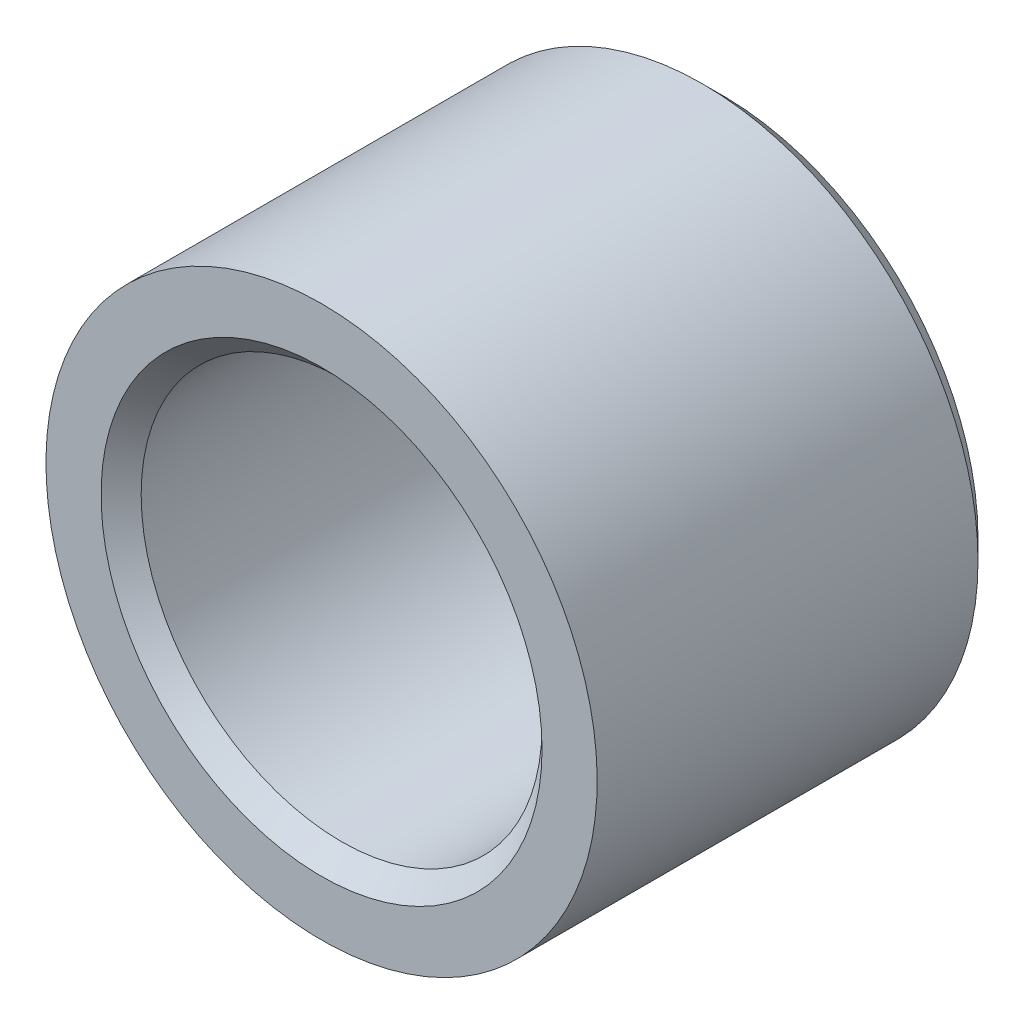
ISO-10303-21;
HEADER;
FILE_DESCRIPTION(('STEP AP214'),'2;1');
FILE_NAME('part.step','',(''),(''),'','','');
FILE_SCHEMA(('AUTOMOTIVE_DESIGN { 1 0 10303 214 1 1 1 1 }'));
ENDSEC;
DATA;
#1=APPLICATION_CONTEXT('core data for automotive mechanical design processes');
#2=APPLICATION_PROTOCOL_DEFINITION('international standard','automotive_design',2000,#1);
#3=PRODUCT_CONTEXT('',#1,'mechanical');
#4=PRODUCT('Part','Part','',(#3));
#5=PRODUCT_RELATED_PRODUCT_CATEGORY('part','',(#4));
#6=PRODUCT_DEFINITION_FORMATION('','',#4);
#7=PRODUCT_DEFINITION_CONTEXT('part definition',#1,'design');
#8=PRODUCT_DEFINITION('design','',#6,#7);
#9=PRODUCT_DEFINITION_SHAPE('','',#8);
#10=(LENGTH_UNIT() NAMED_UNIT(*) SI_UNIT(.MILLI.,.METRE.));
#11=(NAMED_UNIT(*) PLANE_ANGLE_UNIT() SI_UNIT($,.RADIAN.));
#12=(NAMED_UNIT(*) SI_UNIT($,.STERADIAN.) SOLID_ANGLE_UNIT());
#13=UNCERTAINTY_MEASURE_WITH_UNIT(LENGTH_MEASURE(1.E-05),#10,'distance_accuracy_value','');
#14=(GEOMETRIC_REPRESENTATION_CONTEXT(3) GLOBAL_UNCERTAINTY_ASSIGNED_CONTEXT((#13)) GLOBAL_UNIT_ASSIGNED_CONTEXT((#10,
#11,#12)) REPRESENTATION_CONTEXT('',''));
#15=CARTESIAN_POINT('',(0.,0.,0.));
#16=DIRECTION('',(0.,0.,1.));
#17=DIRECTION('',(1.,0.,0.));
#18=AXIS2_PLACEMENT_3D('',#15,#16,#17);
#19=CARTESIAN_POINT('',(0.,0.,4.));
#20=DIRECTION('',(0.,0.,-1.));
#21=DIRECTION('',(0.,1.,0.));
#22=AXIS2_PLACEMENT_3D('',#19,#20,#21);
#23=CYLINDRICAL_SURFACE('',#22,2.);
#24=CARTESIAN_POINT('',(0.,0.,0.));
#25=DIRECTION('',(0.,0.,-1.));
#26=DIRECTION('',(0.,1.,0.));
#27=AXIS2_PLACEMENT_3D('',#24,#25,#26);
#28=CIRCLE('',#27,2.);
#29=CARTESIAN_POINT('',(0.,2.,0.));
#30=VERTEX_POINT('',#29);
#31=EDGE_CURVE('E17',#30,#30,#28,.T.);
#32=ORIENTED_EDGE('',*,*,#31,.T.);
#33=EDGE_LOOP('',(#32));
#34=FACE_BOUND('',#33,.T.);
#35=CARTESIAN_POINT('',(0.,0.,3.80000000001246));
#36=DIRECTION('',(0.,0.,1.));
#37=DIRECTION('',(0.,-1.,0.));
#38=AXIS2_PLACEMENT_3D('',#35,#36,#37);
#39=CIRCLE('',#38,2.00000000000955);
#40=CARTESIAN_POINT('',(0.,-2.00000000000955,3.80000000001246));
#41=VERTEX_POINT('',#40);
#42=EDGE_CURVE('E31',#41,#41,#39,.T.);
#43=ORIENTED_EDGE('',*,*,#42,.T.);
#44=EDGE_LOOP('',(#43));
#45=FACE_BOUND('',#44,.T.);
#46=ADVANCED_FACE('F14',(#34,#45),#23,.F.);
#47=CARTESIAN_POINT('',(0.,0.,3.99999999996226));
#48=DIRECTION('',(0.,0.,1.));
#49=DIRECTION('',(1.,0.,0.));
#50=AXIS2_PLACEMENT_3D('',#47,#48,#49);
#51=CONICAL_SURFACE('',#50,2.19999999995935,0.785398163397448);
#52=ORIENTED_EDGE('',*,*,#42,.F.);
#53=EDGE_LOOP('',(#52));
#54=FACE_BOUND('',#53,.T.);
#55=CARTESIAN_POINT('',(0.,0.,3.99999999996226));
#56=DIRECTION('',(0.,0.,1.));
#57=DIRECTION('',(1.,0.,0.));
#58=AXIS2_PLACEMENT_3D('',#55,#56,#57);
#59=CIRCLE('',#58,2.19999999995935);
#60=CARTESIAN_POINT('',(2.19999999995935,0.,3.99999999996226));
#61=VERTEX_POINT('',#60);
#62=EDGE_CURVE('E35',#61,#61,#59,.F.);
#63=ORIENTED_EDGE('',*,*,#62,.F.);
#64=EDGE_LOOP('',(#63));
#65=FACE_BOUND('',#64,.T.);
#66=ADVANCED_FACE('F48',(#54,#65),#51,.F.);
#67=CARTESIAN_POINT('',(0.,0.,0.));
#68=DIRECTION('',(0.,0.,1.));
#69=DIRECTION('',(0.,-1.,0.));
#70=AXIS2_PLACEMENT_3D('',#67,#68,#69);
#71=PLANE('',#70);
#72=ORIENTED_EDGE('',*,*,#31,.F.);
#73=EDGE_LOOP('',(#72));
#74=FACE_BOUND('',#73,.T.);
#75=CARTESIAN_POINT('',(0.,0.,0.));
#76=DIRECTION('',(0.,0.,1.));
#77=DIRECTION('',(1.,0.,0.));
#78=AXIS2_PLACEMENT_3D('',#75,#76,#77);
#79=CIRCLE('',#78,2.55000000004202);
#80=CARTESIAN_POINT('',(2.55000000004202,0.,0.));
#81=VERTEX_POINT('',#80);
#82=EDGE_CURVE('E26',#81,#81,#79,.T.);
#83=ORIENTED_EDGE('',*,*,#82,.F.);
#84=EDGE_LOOP('',(#83));
#85=FACE_BOUND('',#84,.T.);
#86=ADVANCED_FACE('F44',(#74,#85),#71,.F.);
#87=CARTESIAN_POINT('',(0.,0.,4.));
#88=DIRECTION('',(0.,0.,1.));
#89=DIRECTION('',(0.,-1.,0.));
#90=AXIS2_PLACEMENT_3D('',#87,#88,#89);
#91=PLANE('',#90);
#92=CARTESIAN_POINT('',(0.,0.,4.));
#93=DIRECTION('',(0.,0.,-1.));
#94=DIRECTION('',(0.,1.,0.));
#95=AXIS2_PLACEMENT_3D('',#92,#93,#94);
#96=CIRCLE('',#95,2.75);
#97=CARTESIAN_POINT('',(0.,2.75,4.));
#98=VERTEX_POINT('',#97);
#99=EDGE_CURVE('E21',#98,#98,#96,.T.);
#100=ORIENTED_EDGE('',*,*,#99,.F.);
#101=EDGE_LOOP('',(#100));
#102=FACE_BOUND('',#101,.T.);
#103=ORIENTED_EDGE('',*,*,#62,.T.);
#104=EDGE_LOOP('',(#103));
#105=FACE_BOUND('',#104,.T.);
#106=ADVANCED_FACE('F47',(#102,#105),#91,.T.);
#107=CARTESIAN_POINT('',(0.,0.,0.199999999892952));
#108=DIRECTION('',(0.,0.,1.));
#109=DIRECTION('',(1.,0.,0.));
#110=AXIS2_PLACEMENT_3D('',#107,#108,#109);
#111=CONICAL_SURFACE('',#110,2.74999999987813,0.78539816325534);
#112=ORIENTED_EDGE('',*,*,#82,.T.);
#113=EDGE_LOOP('',(#112));
#114=FACE_BOUND('',#113,.T.);
#115=CARTESIAN_POINT('',(0.,0.,0.2));
#116=DIRECTION('',(0.,0.,-1.));
#117=DIRECTION('',(0.,1.,0.));
#118=AXIS2_PLACEMENT_3D('',#115,#116,#117);
#119=CIRCLE('',#118,2.75);
#120=CARTESIAN_POINT('',(0.,2.75,0.2));
#121=VERTEX_POINT('',#120);
#122=EDGE_CURVE('E10',#121,#121,#119,.F.);
#123=ORIENTED_EDGE('',*,*,#122,.F.);
#124=EDGE_LOOP('',(#123));
#125=FACE_BOUND('',#124,.T.);
#126=ADVANCED_FACE('F52',(#114,#125),#111,.T.);
#127=CARTESIAN_POINT('',(0.,0.,4.));
#128=DIRECTION('',(0.,0.,-1.));
#129=DIRECTION('',(0.,1.,0.));
#130=AXIS2_PLACEMENT_3D('',#127,#128,#129);
#131=CYLINDRICAL_SURFACE('',#130,2.75);
#132=ORIENTED_EDGE('',*,*,#122,.T.);
#133=EDGE_LOOP('',(#132));
#134=FACE_BOUND('',#133,.T.);
#135=ORIENTED_EDGE('',*,*,#99,.T.);
#136=EDGE_LOOP('',(#135));
#137=FACE_BOUND('',#136,.T.);
#138=ADVANCED_FACE('F55',(#134,#137),#131,.T.);
#139=CLOSED_SHELL('',(#46,#66,#86,#106,#126,#138));
#140=MANIFOLD_SOLID_BREP('B1',#139);
#141=ADVANCED_BREP_SHAPE_REPRESENTATION('',(#18,#140),#14);
#142=SHAPE_DEFINITION_REPRESENTATION(#9,#141);
ENDSEC;
END-ISO-10303-21;
